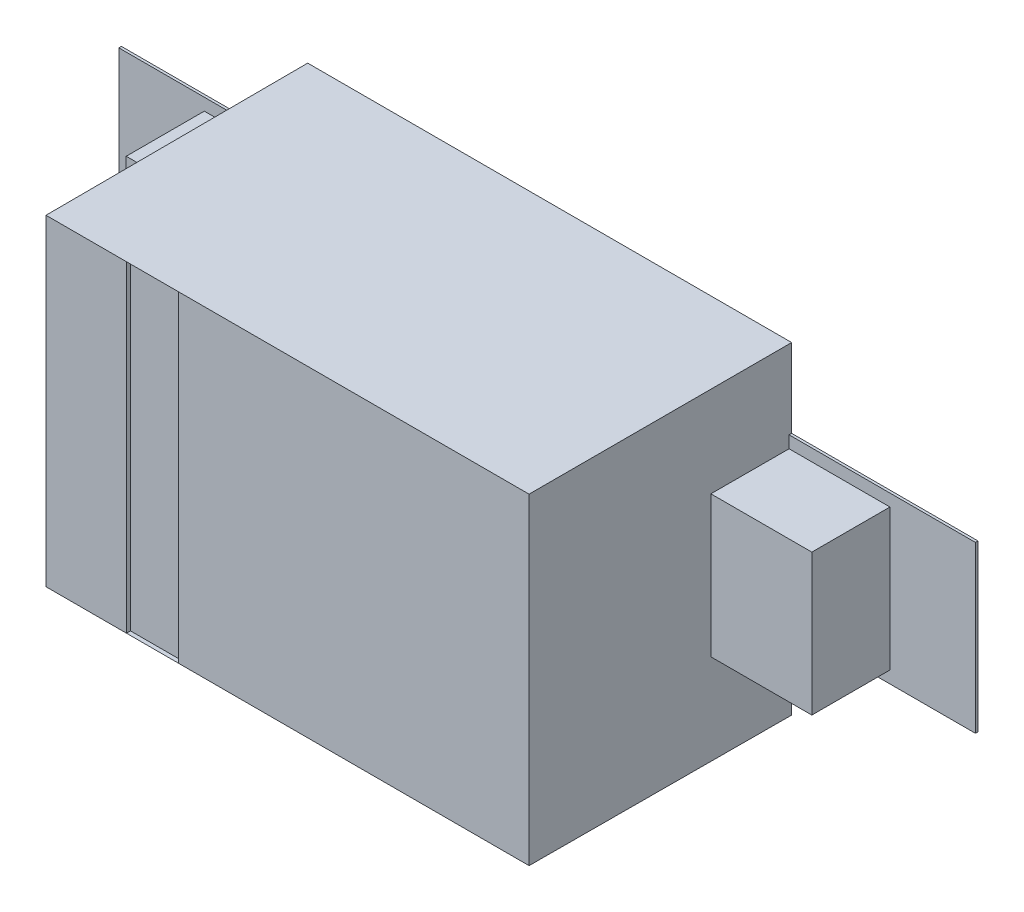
ISO-10303-21;
HEADER;
FILE_DESCRIPTION(('STEP AP214'),'2;1');
FILE_NAME('part.step','',(''),(''),'','','');
FILE_SCHEMA(('AUTOMOTIVE_DESIGN { 1 0 10303 214 1 1 1 1 }'));
ENDSEC;
DATA;
#1=APPLICATION_CONTEXT('core data for automotive mechanical design processes');
#2=APPLICATION_PROTOCOL_DEFINITION('international standard','automotive_design',2000,#1);
#3=PRODUCT_CONTEXT('',#1,'mechanical');
#4=PRODUCT('Part','Part','',(#3));
#5=PRODUCT_RELATED_PRODUCT_CATEGORY('part','',(#4));
#6=PRODUCT_DEFINITION_FORMATION('','',#4);
#7=PRODUCT_DEFINITION_CONTEXT('part definition',#1,'design');
#8=PRODUCT_DEFINITION('design','',#6,#7);
#9=PRODUCT_DEFINITION_SHAPE('','',#8);
#10=(LENGTH_UNIT() NAMED_UNIT(*) SI_UNIT(.MILLI.,.METRE.));
#11=(NAMED_UNIT(*) PLANE_ANGLE_UNIT() SI_UNIT($,.RADIAN.));
#12=(NAMED_UNIT(*) SI_UNIT($,.STERADIAN.) SOLID_ANGLE_UNIT());
#13=UNCERTAINTY_MEASURE_WITH_UNIT(LENGTH_MEASURE(1.E-05),#10,'distance_accuracy_value','');
#14=(GEOMETRIC_REPRESENTATION_CONTEXT(3) GLOBAL_UNCERTAINTY_ASSIGNED_CONTEXT((#13)) GLOBAL_UNIT_ASSIGNED_CONTEXT((#10,
#11,#12)) REPRESENTATION_CONTEXT('',''));
#15=CARTESIAN_POINT('',(0.,0.,0.));
#16=DIRECTION('',(0.,0.,1.));
#17=DIRECTION('',(1.,0.,0.));
#18=AXIS2_PLACEMENT_3D('',#15,#16,#17);
#19=CARTESIAN_POINT('',(0.849999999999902,0.175000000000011,0.0030000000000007));
#20=DIRECTION('',(1.,0.,0.));
#21=DIRECTION('',(0.,0.,-1.));
#22=AXIS2_PLACEMENT_3D('',#19,#20,#21);
#23=PLANE('',#22);
#24=DIRECTION('',(0.,0.,-1.));
#25=VECTOR('',#24,1.);
#26=CARTESIAN_POINT('',(0.849999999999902,-0.175000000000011,0.0030000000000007));
#27=LINE('',#26,#25);
#28=CARTESIAN_POINT('',(0.849999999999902,-0.175000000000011,0.0093500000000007));
#29=VERTEX_POINT('',#28);
#30=CARTESIAN_POINT('',(0.849999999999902,-0.175000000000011,0.203000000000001));
#31=VERTEX_POINT('',#30);
#32=EDGE_CURVE('E180',#29,#31,#27,.F.);
#33=ORIENTED_EDGE('',*,*,#32,.F.);
#34=DIRECTION('',(0.,1.,0.));
#35=VECTOR('',#34,1.);
#36=CARTESIAN_POINT('',(0.849999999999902,0.,0.0093500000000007));
#37=LINE('',#36,#35);
#38=CARTESIAN_POINT('',(0.849999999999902,0.175000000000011,0.0093500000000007));
#39=VERTEX_POINT('',#38);
#40=EDGE_CURVE('E260',#29,#39,#37,.T.);
#41=ORIENTED_EDGE('',*,*,#40,.T.);
#42=DIRECTION('',(0.,0.,1.));
#43=VECTOR('',#42,1.);
#44=CARTESIAN_POINT('',(0.849999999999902,0.175000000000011,0.0030000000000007));
#45=LINE('',#44,#43);
#46=CARTESIAN_POINT('',(0.849999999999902,0.175000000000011,0.203000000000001));
#47=VERTEX_POINT('',#46);
#48=EDGE_CURVE('E196',#47,#39,#45,.F.);
#49=ORIENTED_EDGE('',*,*,#48,.F.);
#50=DIRECTION('',(0.,1.,0.));
#51=VECTOR('',#50,1.);
#52=CARTESIAN_POINT('',(0.849999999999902,0.,0.203000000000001));
#53=LINE('',#52,#51);
#54=EDGE_CURVE('E174',#47,#31,#53,.F.);
#55=ORIENTED_EDGE('',*,*,#54,.T.);
#56=EDGE_LOOP('',(#33,#41,#49,#55));
#57=FACE_BOUND('',#56,.T.);
#58=ADVANCED_FACE('F16',(#57),#23,.T.);
#59=CARTESIAN_POINT('',(-0.849999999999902,-0.175000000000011,0.0030000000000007));
#60=DIRECTION('',(-1.,0.,0.));
#61=DIRECTION('',(0.,0.,1.));
#62=AXIS2_PLACEMENT_3D('',#59,#60,#61);
#63=PLANE('',#62);
#64=DIRECTION('',(0.,0.,1.));
#65=VECTOR('',#64,1.);
#66=CARTESIAN_POINT('',(-0.849999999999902,0.175000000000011,0.0030000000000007));
#67=LINE('',#66,#65);
#68=CARTESIAN_POINT('',(-0.849999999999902,0.175000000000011,0.0093500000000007));
#69=VERTEX_POINT('',#68);
#70=CARTESIAN_POINT('',(-0.849999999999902,0.175000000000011,0.203000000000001));
#71=VERTEX_POINT('',#70);
#72=EDGE_CURVE('E249',#69,#71,#67,.T.);
#73=ORIENTED_EDGE('',*,*,#72,.F.);
#74=DIRECTION('',(0.,1.,0.));
#75=VECTOR('',#74,1.);
#76=CARTESIAN_POINT('',(-0.849999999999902,0.,0.0093500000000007));
#77=LINE('',#76,#75);
#78=CARTESIAN_POINT('',(-0.849999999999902,-0.175000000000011,0.0093500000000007));
#79=VERTEX_POINT('',#78);
#80=EDGE_CURVE('E232',#69,#79,#77,.F.);
#81=ORIENTED_EDGE('',*,*,#80,.T.);
#82=DIRECTION('',(0.,0.,-1.));
#83=VECTOR('',#82,1.);
#84=CARTESIAN_POINT('',(-0.849999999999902,-0.175000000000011,0.0030000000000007));
#85=LINE('',#84,#83);
#86=CARTESIAN_POINT('',(-0.849999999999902,-0.175000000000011,0.203000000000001));
#87=VERTEX_POINT('',#86);
#88=EDGE_CURVE('E238',#87,#79,#85,.T.);
#89=ORIENTED_EDGE('',*,*,#88,.F.);
#90=DIRECTION('',(0.,1.,0.));
#91=VECTOR('',#90,1.);
#92=CARTESIAN_POINT('',(-0.849999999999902,0.,0.203000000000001));
#93=LINE('',#92,#91);
#94=EDGE_CURVE('E246',#87,#71,#93,.T.);
#95=ORIENTED_EDGE('',*,*,#94,.T.);
#96=EDGE_LOOP('',(#73,#81,#89,#95));
#97=FACE_BOUND('',#96,.T.);
#98=ADVANCED_FACE('F498',(#97),#63,.T.);
#99=CARTESIAN_POINT('',(-0.399389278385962,0.39886555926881,0.652985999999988));
#100=DIRECTION('',(-1.,0.,0.));
#101=DIRECTION('',(0.,0.,1.));
#102=AXIS2_PLACEMENT_3D('',#99,#100,#101);
#103=PLANE('',#102);
#104=DIRECTION('',(0.,1.,0.));
#105=VECTOR('',#104,1.);
#106=CARTESIAN_POINT('',(-0.399389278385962,0.,0.642986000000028));
#107=LINE('',#106,#105);
#108=CARTESIAN_POINT('',(-0.399389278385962,0.39886555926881,0.642986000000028));
#109=VERTEX_POINT('',#108);
#110=CARTESIAN_POINT('',(-0.399389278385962,-0.39886555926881,0.642986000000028));
#111=VERTEX_POINT('',#110);
#112=EDGE_CURVE('E19',#109,#111,#107,.F.);
#113=ORIENTED_EDGE('',*,*,#112,.F.);
#114=DIRECTION('',(0.,0.,1.));
#115=VECTOR('',#114,1.);
#116=CARTESIAN_POINT('',(-0.399389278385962,0.39886555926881,0.652985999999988));
#117=LINE('',#116,#115);
#118=CARTESIAN_POINT('',(-0.399389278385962,0.398865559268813,0.652985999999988));
#119=VERTEX_POINT('',#118);
#120=EDGE_CURVE('E251',#109,#119,#117,.T.);
#121=ORIENTED_EDGE('',*,*,#120,.T.);
#122=DIRECTION('',(0.,1.,0.));
#123=VECTOR('',#122,1.);
#124=CARTESIAN_POINT('',(-0.399389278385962,0.,0.652985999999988));
#125=LINE('',#124,#123);
#126=CARTESIAN_POINT('',(-0.399389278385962,-0.398865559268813,0.652985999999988));
#127=VERTEX_POINT('',#126);
#128=EDGE_CURVE('E221',#127,#119,#125,.T.);
#129=ORIENTED_EDGE('',*,*,#128,.F.);
#130=DIRECTION('',(0.,0.,-1.));
#131=VECTOR('',#130,1.);
#132=CARTESIAN_POINT('',(-0.399389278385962,-0.39886555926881,0.652985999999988));
#133=LINE('',#132,#131);
#134=EDGE_CURVE('E215',#127,#111,#133,.T.);
#135=ORIENTED_EDGE('',*,*,#134,.T.);
#136=EDGE_LOOP('',(#113,#121,#129,#135));
#137=FACE_BOUND('',#136,.T.);
#138=ADVANCED_FACE('F220',(#137),#103,.F.);
#139=CARTESIAN_POINT('',(0.,0.,0.642986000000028));
#140=DIRECTION('',(0.,0.,1.));
#141=DIRECTION('',(1.,0.,0.));
#142=AXIS2_PLACEMENT_3D('',#139,#140,#141);
#143=PLANE('',#142);
#144=DIRECTION('',(1.,0.,0.));
#145=VECTOR('',#144,1.);
#146=CARTESIAN_POINT('',(-0.270648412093,0.39886555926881,0.642986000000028));
#147=LINE('',#146,#145);
#148=CARTESIAN_POINT('',(-0.270648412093,0.39886555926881,0.642986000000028));
#149=VERTEX_POINT('',#148);
#150=EDGE_CURVE('E206',#149,#109,#147,.F.);
#151=ORIENTED_EDGE('',*,*,#150,.T.);
#152=ORIENTED_EDGE('',*,*,#112,.T.);
#153=DIRECTION('',(1.,0.,0.));
#154=VECTOR('',#153,1.);
#155=CARTESIAN_POINT('',(-0.399389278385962,-0.39886555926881,0.642986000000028));
#156=LINE('',#155,#154);
#157=CARTESIAN_POINT('',(-0.270648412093,-0.39886555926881,0.642986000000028));
#158=VERTEX_POINT('',#157);
#159=EDGE_CURVE('E205',#111,#158,#156,.T.);
#160=ORIENTED_EDGE('',*,*,#159,.T.);
#161=DIRECTION('',(0.,1.,0.));
#162=VECTOR('',#161,1.);
#163=CARTESIAN_POINT('',(-0.270648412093,-0.39886555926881,0.642986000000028));
#164=LINE('',#163,#162);
#165=EDGE_CURVE('E189',#158,#149,#164,.T.);
#166=ORIENTED_EDGE('',*,*,#165,.T.);
#167=EDGE_LOOP('',(#151,#152,#160,#166));
#168=FACE_BOUND('',#167,.T.);
#169=ADVANCED_FACE('F204',(#168),#143,.T.);
#170=CARTESIAN_POINT('',(-0.270648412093,-0.39886555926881,0.652985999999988));
#171=DIRECTION('',(1.,0.,0.));
#172=DIRECTION('',(0.,0.,-1.));
#173=AXIS2_PLACEMENT_3D('',#170,#171,#172);
#174=PLANE('',#173);
#175=ORIENTED_EDGE('',*,*,#165,.F.);
#176=DIRECTION('',(0.,0.,-1.));
#177=VECTOR('',#176,1.);
#178=CARTESIAN_POINT('',(-0.270648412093,-0.39886555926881,0.652985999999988));
#179=LINE('',#178,#177);
#180=CARTESIAN_POINT('',(-0.270648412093,-0.398865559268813,0.652985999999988));
#181=VERTEX_POINT('',#180);
#182=EDGE_CURVE('E218',#158,#181,#179,.F.);
#183=ORIENTED_EDGE('',*,*,#182,.T.);
#184=DIRECTION('',(0.,1.,0.));
#185=VECTOR('',#184,1.);
#186=CARTESIAN_POINT('',(-0.270648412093,0.,0.652985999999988));
#187=LINE('',#186,#185);
#188=CARTESIAN_POINT('',(-0.270648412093,0.398865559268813,0.652985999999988));
#189=VERTEX_POINT('',#188);
#190=EDGE_CURVE('E223',#189,#181,#187,.F.);
#191=ORIENTED_EDGE('',*,*,#190,.F.);
#192=DIRECTION('',(0.,0.,1.));
#193=VECTOR('',#192,1.);
#194=CARTESIAN_POINT('',(-0.270648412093,0.39886555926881,0.652985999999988));
#195=LINE('',#194,#193);
#196=EDGE_CURVE('E254',#189,#149,#195,.F.);
#197=ORIENTED_EDGE('',*,*,#196,.T.);
#198=EDGE_LOOP('',(#175,#183,#191,#197));
#199=FACE_BOUND('',#198,.T.);
#200=ADVANCED_FACE('F301',(#199),#174,.F.);
#201=CARTESIAN_POINT('',(0.849999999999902,-0.175000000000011,0.0030000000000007));
#202=DIRECTION('',(0.,-1.,0.));
#203=DIRECTION('',(0.,0.,-1.));
#204=AXIS2_PLACEMENT_3D('',#201,#202,#203);
#205=PLANE('',#204);
#206=DIRECTION('',(0.00174532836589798,0.,-0.999998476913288));
#207=VECTOR('',#206,1.);
#208=CARTESIAN_POINT('',(0.599999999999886,-0.175000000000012,0.0030000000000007));
#209=LINE('',#208,#207);
#210=CARTESIAN_POINT('',(0.599988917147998,-0.175000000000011,0.00935000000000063));
#211=VERTEX_POINT('',#210);
#212=CARTESIAN_POINT('',(0.599650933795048,-0.175000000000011,0.203000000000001));
#213=VERTEX_POINT('',#212);
#214=EDGE_CURVE('E275',#211,#213,#209,.F.);
#215=ORIENTED_EDGE('',*,*,#214,.F.);
#216=DIRECTION('',(-1.,0.,0.));
#217=VECTOR('',#216,1.);
#218=CARTESIAN_POINT('',(0.,-0.175000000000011,0.0093500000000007));
#219=LINE('',#218,#217);
#220=EDGE_CURVE('E185',#211,#29,#219,.F.);
#221=ORIENTED_EDGE('',*,*,#220,.T.);
#222=ORIENTED_EDGE('',*,*,#32,.T.);
#223=DIRECTION('',(-1.,0.,0.));
#224=VECTOR('',#223,1.);
#225=CARTESIAN_POINT('',(0.,-0.175000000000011,0.203000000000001));
#226=LINE('',#225,#224);
#227=EDGE_CURVE('E183',#31,#213,#226,.T.);
#228=ORIENTED_EDGE('',*,*,#227,.T.);
#229=EDGE_LOOP('',(#215,#221,#222,#228));
#230=FACE_BOUND('',#229,.T.);
#231=ADVANCED_FACE('F182',(#230),#205,.T.);
#232=CARTESIAN_POINT('',(0.,0.,0.203000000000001));
#233=DIRECTION('',(0.,0.,-1.));
#234=DIRECTION('',(-1.,0.,0.));
#235=AXIS2_PLACEMENT_3D('',#232,#233,#234);
#236=PLANE('',#235);
#237=ORIENTED_EDGE('',*,*,#54,.F.);
#238=DIRECTION('',(1.,0.,0.));
#239=VECTOR('',#238,1.);
#240=CARTESIAN_POINT('',(0.538999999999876,0.175000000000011,0.203000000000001));
#241=LINE('',#240,#239);
#242=CARTESIAN_POINT('',(0.599650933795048,0.175000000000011,0.203000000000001));
#243=VERTEX_POINT('',#242);
#244=EDGE_CURVE('E193',#243,#47,#241,.T.);
#245=ORIENTED_EDGE('',*,*,#244,.F.);
#246=DIRECTION('',(0.,1.,0.));
#247=VECTOR('',#246,1.);
#248=CARTESIAN_POINT('',(0.599650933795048,-25.8310794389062,0.203000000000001));
#249=LINE('',#248,#247);
#250=EDGE_CURVE('E192',#213,#243,#249,.T.);
#251=ORIENTED_EDGE('',*,*,#250,.F.);
#252=ORIENTED_EDGE('',*,*,#227,.F.);
#253=EDGE_LOOP('',(#237,#245,#251,#252));
#254=FACE_BOUND('',#253,.T.);
#255=ADVANCED_FACE('F191',(#254),#236,.F.);
#256=CARTESIAN_POINT('',(0.538999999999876,0.175000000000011,0.0030000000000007));
#257=DIRECTION('',(0.,1.,0.));
#258=DIRECTION('',(0.,0.,1.));
#259=AXIS2_PLACEMENT_3D('',#256,#257,#258);
#260=PLANE('',#259);
#261=ORIENTED_EDGE('',*,*,#48,.T.);
#262=DIRECTION('',(-1.,0.,0.));
#263=VECTOR('',#262,1.);
#264=CARTESIAN_POINT('',(0.,0.175000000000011,0.0093500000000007));
#265=LINE('',#264,#263);
#266=CARTESIAN_POINT('',(0.599988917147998,0.175000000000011,0.00935000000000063));
#267=VERTEX_POINT('',#266);
#268=EDGE_CURVE('E257',#39,#267,#265,.T.);
#269=ORIENTED_EDGE('',*,*,#268,.T.);
#270=DIRECTION('',(0.00174532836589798,0.,-0.999998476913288));
#271=VECTOR('',#270,1.);
#272=CARTESIAN_POINT('',(0.599999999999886,0.175000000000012,0.0030000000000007));
#273=LINE('',#272,#271);
#274=EDGE_CURVE('E267',#243,#267,#273,.T.);
#275=ORIENTED_EDGE('',*,*,#274,.F.);
#276=ORIENTED_EDGE('',*,*,#244,.T.);
#277=EDGE_LOOP('',(#261,#269,#275,#276));
#278=FACE_BOUND('',#277,.T.);
#279=ADVANCED_FACE('F265',(#278),#260,.T.);
#280=CARTESIAN_POINT('',(0.,0.,0.0093500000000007));
#281=DIRECTION('',(0.,0.,-1.));
#282=DIRECTION('',(-1.,0.,0.));
#283=AXIS2_PLACEMENT_3D('',#280,#281,#282);
#284=PLANE('',#283);
#285=ORIENTED_EDGE('',*,*,#40,.F.);
#286=ORIENTED_EDGE('',*,*,#220,.F.);
#287=DIRECTION('',(0.,1.,0.));
#288=VECTOR('',#287,1.);
#289=CARTESIAN_POINT('',(0.599988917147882,-25.8310794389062,0.00935000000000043));
#290=LINE('',#289,#288);
#291=CARTESIAN_POINT('',(0.599988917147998,-0.204999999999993,0.00935000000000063));
#292=VERTEX_POINT('',#291);
#293=EDGE_CURVE('E280',#292,#211,#290,.T.);
#294=ORIENTED_EDGE('',*,*,#293,.F.);
#295=DIRECTION('',(1.,0.,0.));
#296=VECTOR('',#295,1.);
#297=CARTESIAN_POINT('',(1.06200000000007,-0.204999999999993,0.0093500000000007));
#298=LINE('',#297,#296);
#299=CARTESIAN_POINT('',(1.06200000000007,-0.204999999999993,0.0093500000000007));
#300=VERTEX_POINT('',#299);
#301=EDGE_CURVE('E298',#300,#292,#298,.F.);
#302=ORIENTED_EDGE('',*,*,#301,.F.);
#303=DIRECTION('',(0.,1.,0.));
#304=VECTOR('',#303,1.);
#305=CARTESIAN_POINT('',(1.06200000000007,0.204999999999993,0.0093500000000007));
#306=LINE('',#305,#304);
#307=CARTESIAN_POINT('',(1.06200000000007,0.204999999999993,0.0093500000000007));
#308=VERTEX_POINT('',#307);
#309=EDGE_CURVE('E296',#308,#300,#306,.F.);
#310=ORIENTED_EDGE('',*,*,#309,.F.);
#311=DIRECTION('',(1.,0.,0.));
#312=VECTOR('',#311,1.);
#313=CARTESIAN_POINT('',(0.372000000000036,0.204999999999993,0.0093500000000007));
#314=LINE('',#313,#312);
#315=CARTESIAN_POINT('',(0.599988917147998,0.204999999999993,0.00935000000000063));
#316=VERTEX_POINT('',#315);
#317=EDGE_CURVE('E292',#316,#308,#314,.T.);
#318=ORIENTED_EDGE('',*,*,#317,.F.);
#319=DIRECTION('',(0.,1.,0.));
#320=VECTOR('',#319,1.);
#321=CARTESIAN_POINT('',(0.599988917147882,-25.8310794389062,0.00935000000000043));
#322=LINE('',#321,#320);
#323=EDGE_CURVE('E271',#267,#316,#322,.T.);
#324=ORIENTED_EDGE('',*,*,#323,.F.);
#325=ORIENTED_EDGE('',*,*,#268,.F.);
#326=EDGE_LOOP('',(#285,#286,#294,#302,#310,#318,#324,#325));
#327=FACE_BOUND('',#326,.T.);
#328=ADVANCED_FACE('F425',(#327),#284,.F.);
#329=CARTESIAN_POINT('',(-0.270648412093,0.39886555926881,0.652985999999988));
#330=DIRECTION('',(0.,1.,0.));
#331=DIRECTION('',(0.,0.,1.));
#332=AXIS2_PLACEMENT_3D('',#329,#330,#331);
#333=PLANE('',#332);
#334=ORIENTED_EDGE('',*,*,#150,.F.);
#335=ORIENTED_EDGE('',*,*,#196,.F.);
#336=DIRECTION('',(1.,0.,0.));
#337=VECTOR('',#336,1.);
#338=CARTESIAN_POINT('',(26.0310794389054,0.398865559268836,0.652985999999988));
#339=LINE('',#338,#337);
#340=EDGE_CURVE('E351',#119,#189,#339,.T.);
#341=ORIENTED_EDGE('',*,*,#340,.F.);
#342=ORIENTED_EDGE('',*,*,#120,.F.);
#343=EDGE_LOOP('',(#334,#335,#341,#342));
#344=FACE_BOUND('',#343,.T.);
#345=ADVANCED_FACE('F422',(#344),#333,.F.);
#346=CARTESIAN_POINT('',(-0.849999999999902,0.175000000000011,0.0030000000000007));
#347=DIRECTION('',(0.,1.,0.));
#348=DIRECTION('',(0.,0.,1.));
#349=AXIS2_PLACEMENT_3D('',#346,#347,#348);
#350=PLANE('',#349);
#351=DIRECTION('',(-1.,0.,0.));
#352=VECTOR('',#351,1.);
#353=CARTESIAN_POINT('',(0.,0.175000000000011,0.203000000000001));
#354=LINE('',#353,#352);
#355=CARTESIAN_POINT('',(-0.599650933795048,0.175000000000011,0.203000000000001));
#356=VERTEX_POINT('',#355);
#357=EDGE_CURVE('E243',#71,#356,#354,.F.);
#358=ORIENTED_EDGE('',*,*,#357,.T.);
#359=DIRECTION('',(0.00174532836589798,0.,0.999998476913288));
#360=VECTOR('',#359,1.);
#361=CARTESIAN_POINT('',(-0.599999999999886,0.175000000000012,0.0030000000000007));
#362=LINE('',#361,#360);
#363=CARTESIAN_POINT('',(-0.599988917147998,0.175000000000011,0.00935000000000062));
#364=VERTEX_POINT('',#363);
#365=EDGE_CURVE('E339',#364,#356,#362,.T.);
#366=ORIENTED_EDGE('',*,*,#365,.F.);
#367=DIRECTION('',(-1.,0.,0.));
#368=VECTOR('',#367,1.);
#369=CARTESIAN_POINT('',(0.,0.175000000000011,0.0093500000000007));
#370=LINE('',#369,#368);
#371=EDGE_CURVE('E235',#364,#69,#370,.T.);
#372=ORIENTED_EDGE('',*,*,#371,.T.);
#373=ORIENTED_EDGE('',*,*,#72,.T.);
#374=EDGE_LOOP('',(#358,#366,#372,#373));
#375=FACE_BOUND('',#374,.T.);
#376=ADVANCED_FACE('F424',(#375),#350,.T.);
#377=CARTESIAN_POINT('',(0.,0.,0.203000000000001));
#378=DIRECTION('',(0.,0.,-1.));
#379=DIRECTION('',(-1.,0.,0.));
#380=AXIS2_PLACEMENT_3D('',#377,#378,#379);
#381=PLANE('',#380);
#382=ORIENTED_EDGE('',*,*,#94,.F.);
#383=DIRECTION('',(1.,0.,0.));
#384=VECTOR('',#383,1.);
#385=CARTESIAN_POINT('',(-0.538999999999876,-0.175000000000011,0.203000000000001));
#386=LINE('',#385,#384);
#387=CARTESIAN_POINT('',(-0.599650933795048,-0.175000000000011,0.203000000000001));
#388=VERTEX_POINT('',#387);
#389=EDGE_CURVE('E240',#388,#87,#386,.F.);
#390=ORIENTED_EDGE('',*,*,#389,.F.);
#391=DIRECTION('',(0.,1.,0.));
#392=VECTOR('',#391,1.);
#393=CARTESIAN_POINT('',(-0.599650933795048,25.8310794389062,0.203000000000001));
#394=LINE('',#393,#392);
#395=EDGE_CURVE('E337',#356,#388,#394,.F.);
#396=ORIENTED_EDGE('',*,*,#395,.F.);
#397=ORIENTED_EDGE('',*,*,#357,.F.);
#398=EDGE_LOOP('',(#382,#390,#396,#397));
#399=FACE_BOUND('',#398,.T.);
#400=ADVANCED_FACE('F432',(#399),#381,.F.);
#401=CARTESIAN_POINT('',(-0.538999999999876,-0.175000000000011,0.0030000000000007));
#402=DIRECTION('',(0.,-1.,0.));
#403=DIRECTION('',(0.,0.,-1.));
#404=AXIS2_PLACEMENT_3D('',#401,#402,#403);
#405=PLANE('',#404);
#406=DIRECTION('',(-1.,0.,0.));
#407=VECTOR('',#406,1.);
#408=CARTESIAN_POINT('',(0.,-0.175000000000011,0.0093500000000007));
#409=LINE('',#408,#407);
#410=CARTESIAN_POINT('',(-0.599988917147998,-0.175000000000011,0.00935000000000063));
#411=VERTEX_POINT('',#410);
#412=EDGE_CURVE('E229',#79,#411,#409,.F.);
#413=ORIENTED_EDGE('',*,*,#412,.T.);
#414=DIRECTION('',(0.00174532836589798,0.,0.999998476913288));
#415=VECTOR('',#414,1.);
#416=CARTESIAN_POINT('',(-0.599999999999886,-0.175000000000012,0.0030000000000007));
#417=LINE('',#416,#415);
#418=EDGE_CURVE('E335',#388,#411,#417,.F.);
#419=ORIENTED_EDGE('',*,*,#418,.F.);
#420=ORIENTED_EDGE('',*,*,#389,.T.);
#421=ORIENTED_EDGE('',*,*,#88,.T.);
#422=EDGE_LOOP('',(#413,#419,#420,#421));
#423=FACE_BOUND('',#422,.T.);
#424=ADVANCED_FACE('F482',(#423),#405,.T.);
#425=CARTESIAN_POINT('',(0.,0.,0.0093500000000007));
#426=DIRECTION('',(0.,0.,-1.));
#427=DIRECTION('',(-1.,0.,0.));
#428=AXIS2_PLACEMENT_3D('',#425,#426,#427);
#429=PLANE('',#428);
#430=DIRECTION('',(0.,1.,0.));
#431=VECTOR('',#430,1.);
#432=CARTESIAN_POINT('',(-1.06200000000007,-0.204999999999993,0.0093500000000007));
#433=LINE('',#432,#431);
#434=CARTESIAN_POINT('',(-1.06200000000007,-0.204999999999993,0.0093500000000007));
#435=VERTEX_POINT('',#434);
#436=CARTESIAN_POINT('',(-1.06200000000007,0.204999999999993,0.0093500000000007));
#437=VERTEX_POINT('',#436);
#438=EDGE_CURVE('E347',#435,#437,#433,.T.);
#439=ORIENTED_EDGE('',*,*,#438,.F.);
#440=DIRECTION('',(1.,0.,0.));
#441=VECTOR('',#440,1.);
#442=CARTESIAN_POINT('',(-0.372000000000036,-0.204999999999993,0.0093500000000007));
#443=LINE('',#442,#441);
#444=CARTESIAN_POINT('',(-0.599988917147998,-0.204999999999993,0.00935000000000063));
#445=VERTEX_POINT('',#444);
#446=EDGE_CURVE('E343',#445,#435,#443,.F.);
#447=ORIENTED_EDGE('',*,*,#446,.F.);
#448=DIRECTION('',(0.,1.,0.));
#449=VECTOR('',#448,1.);
#450=CARTESIAN_POINT('',(-0.599988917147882,25.8310794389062,0.00935000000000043));
#451=LINE('',#450,#449);
#452=EDGE_CURVE('E333',#411,#445,#451,.F.);
#453=ORIENTED_EDGE('',*,*,#452,.F.);
#454=ORIENTED_EDGE('',*,*,#412,.F.);
#455=ORIENTED_EDGE('',*,*,#80,.F.);
#456=ORIENTED_EDGE('',*,*,#371,.F.);
#457=DIRECTION('',(0.,1.,0.));
#458=VECTOR('',#457,1.);
#459=CARTESIAN_POINT('',(-0.599988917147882,25.8310794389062,0.00935000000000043));
#460=LINE('',#459,#458);
#461=CARTESIAN_POINT('',(-0.599988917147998,0.204999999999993,0.00935000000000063));
#462=VERTEX_POINT('',#461);
#463=EDGE_CURVE('E321',#462,#364,#460,.F.);
#464=ORIENTED_EDGE('',*,*,#463,.F.);
#465=DIRECTION('',(1.,0.,0.));
#466=VECTOR('',#465,1.);
#467=CARTESIAN_POINT('',(-1.06200000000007,0.204999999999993,0.0093500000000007));
#468=LINE('',#467,#466);
#469=EDGE_CURVE('E349',#437,#462,#468,.T.);
#470=ORIENTED_EDGE('',*,*,#469,.F.);
#471=EDGE_LOOP('',(#439,#447,#453,#454,#455,#456,#464,#470));
#472=FACE_BOUND('',#471,.T.);
#473=ADVANCED_FACE('F479',(#472),#429,.F.);
#474=CARTESIAN_POINT('',(0.,0.,0.652985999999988));
#475=DIRECTION('',(0.,0.,1.));
#476=DIRECTION('',(1.,0.,0.));
#477=AXIS2_PLACEMENT_3D('',#474,#475,#476);
#478=PLANE('',#477);
#479=DIRECTION('',(1.,0.,0.));
#480=VECTOR('',#479,1.);
#481=CARTESIAN_POINT('',(-26.0310794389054,-0.398865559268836,0.652985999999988));
#482=LINE('',#481,#480);
#483=CARTESIAN_POINT('',(-0.598865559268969,-0.398865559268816,0.652985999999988));
#484=VERTEX_POINT('',#483);
#485=EDGE_CURVE('E319',#127,#484,#482,.F.);
#486=ORIENTED_EDGE('',*,*,#485,.F.);
#487=ORIENTED_EDGE('',*,*,#128,.T.);
#488=DIRECTION('',(1.,0.,0.));
#489=VECTOR('',#488,1.);
#490=CARTESIAN_POINT('',(26.0310794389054,0.398865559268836,0.652985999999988));
#491=LINE('',#490,#489);
#492=CARTESIAN_POINT('',(-0.598865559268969,0.398865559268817,0.652985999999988));
#493=VERTEX_POINT('',#492);
#494=EDGE_CURVE('E353',#493,#119,#491,.T.);
#495=ORIENTED_EDGE('',*,*,#494,.F.);
#496=DIRECTION('',(0.,1.,0.));
#497=VECTOR('',#496,1.);
#498=CARTESIAN_POINT('',(-0.598865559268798,25.8310794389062,0.652985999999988));
#499=LINE('',#498,#497);
#500=EDGE_CURVE('E329',#484,#493,#499,.T.);
#501=ORIENTED_EDGE('',*,*,#500,.F.);
#502=EDGE_LOOP('',(#486,#487,#495,#501));
#503=FACE_BOUND('',#502,.T.);
#504=ADVANCED_FACE('F476',(#503),#478,.T.);
#505=CARTESIAN_POINT('',(0.,0.,0.652985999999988));
#506=DIRECTION('',(0.,0.,1.));
#507=DIRECTION('',(1.,0.,0.));
#508=AXIS2_PLACEMENT_3D('',#505,#506,#507);
#509=PLANE('',#508);
#510=DIRECTION('',(1.,0.,0.));
#511=VECTOR('',#510,1.);
#512=CARTESIAN_POINT('',(26.0310794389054,0.398865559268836,0.652985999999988));
#513=LINE('',#512,#511);
#514=CARTESIAN_POINT('',(0.598865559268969,0.398865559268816,0.652985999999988));
#515=VERTEX_POINT('',#514);
#516=EDGE_CURVE('E273',#189,#515,#513,.T.);
#517=ORIENTED_EDGE('',*,*,#516,.F.);
#518=ORIENTED_EDGE('',*,*,#190,.T.);
#519=DIRECTION('',(1.,0.,0.));
#520=VECTOR('',#519,1.);
#521=CARTESIAN_POINT('',(-26.0310794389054,-0.398865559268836,0.652985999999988));
#522=LINE('',#521,#520);
#523=CARTESIAN_POINT('',(0.598865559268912,-0.398865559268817,0.652985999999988));
#524=VERTEX_POINT('',#523);
#525=EDGE_CURVE('E307',#524,#181,#522,.F.);
#526=ORIENTED_EDGE('',*,*,#525,.F.);
#527=DIRECTION('',(0.,1.,0.));
#528=VECTOR('',#527,1.);
#529=CARTESIAN_POINT('',(0.598865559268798,-25.8310794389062,0.652985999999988));
#530=LINE('',#529,#528);
#531=EDGE_CURVE('E286',#515,#524,#530,.F.);
#532=ORIENTED_EDGE('',*,*,#531,.F.);
#533=EDGE_LOOP('',(#517,#518,#526,#532));
#534=FACE_BOUND('',#533,.T.);
#535=ADVANCED_FACE('F367',(#534),#509,.T.);
#536=CARTESIAN_POINT('',(-0.399389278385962,-0.39886555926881,0.652985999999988));
#537=DIRECTION('',(0.,-1.,0.));
#538=DIRECTION('',(0.,0.,-1.));
#539=AXIS2_PLACEMENT_3D('',#536,#537,#538);
#540=PLANE('',#539);
#541=ORIENTED_EDGE('',*,*,#159,.F.);
#542=ORIENTED_EDGE('',*,*,#134,.F.);
#543=DIRECTION('',(1.,0.,0.));
#544=VECTOR('',#543,1.);
#545=CARTESIAN_POINT('',(-26.0310794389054,-0.398865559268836,0.652985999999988));
#546=LINE('',#545,#544);
#547=EDGE_CURVE('E303',#181,#127,#546,.F.);
#548=ORIENTED_EDGE('',*,*,#547,.F.);
#549=ORIENTED_EDGE('',*,*,#182,.F.);
#550=EDGE_LOOP('',(#541,#542,#548,#549));
#551=FACE_BOUND('',#550,.T.);
#552=ADVANCED_FACE('F213',(#551),#540,.F.);
#553=CARTESIAN_POINT('',(1.06200000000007,-0.204999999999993,0.0030000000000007));
#554=DIRECTION('',(0.,-1.,0.));
#555=DIRECTION('',(0.,0.,-1.));
#556=AXIS2_PLACEMENT_3D('',#553,#554,#555);
#557=PLANE('',#556);
#558=ORIENTED_EDGE('',*,*,#301,.T.);
#559=DIRECTION('',(0.00174532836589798,0.,-0.999998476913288));
#560=VECTOR('',#559,1.);
#561=CARTESIAN_POINT('',(0.599999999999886,-0.204999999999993,0.0030000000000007));
#562=LINE('',#561,#560);
#563=CARTESIAN_POINT('',(0.599999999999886,-0.204999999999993,0.0030000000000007));
#564=VERTEX_POINT('',#563);
#565=EDGE_CURVE('E283',#564,#292,#562,.F.);
#566=ORIENTED_EDGE('',*,*,#565,.F.);
#567=DIRECTION('',(1.,0.,0.));
#568=VECTOR('',#567,1.);
#569=CARTESIAN_POINT('',(0.,-0.204999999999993,0.0030000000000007));
#570=LINE('',#569,#568);
#571=CARTESIAN_POINT('',(1.06200000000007,-0.204999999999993,0.0030000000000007));
#572=VERTEX_POINT('',#571);
#573=EDGE_CURVE('E310',#564,#572,#570,.T.);
#574=ORIENTED_EDGE('',*,*,#573,.T.);
#575=DIRECTION('',(0.,0.,-1.));
#576=VECTOR('',#575,1.);
#577=CARTESIAN_POINT('',(1.06200000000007,-0.204999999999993,0.0030000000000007));
#578=LINE('',#577,#576);
#579=EDGE_CURVE('E294',#300,#572,#578,.T.);
#580=ORIENTED_EDGE('',*,*,#579,.F.);
#581=EDGE_LOOP('',(#558,#566,#574,#580));
#582=FACE_BOUND('',#581,.T.);
#583=ADVANCED_FACE('F391',(#582),#557,.T.);
#584=CARTESIAN_POINT('',(1.06200000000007,0.204999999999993,0.0030000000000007));
#585=DIRECTION('',(1.,0.,0.));
#586=DIRECTION('',(0.,0.,-1.));
#587=AXIS2_PLACEMENT_3D('',#584,#585,#586);
#588=PLANE('',#587);
#589=ORIENTED_EDGE('',*,*,#579,.T.);
#590=DIRECTION('',(0.,1.,0.));
#591=VECTOR('',#590,1.);
#592=CARTESIAN_POINT('',(1.06200000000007,0.,0.0030000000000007));
#593=LINE('',#592,#591);
#594=CARTESIAN_POINT('',(1.06200000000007,0.204999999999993,0.0030000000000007));
#595=VERTEX_POINT('',#594);
#596=EDGE_CURVE('E382',#572,#595,#593,.T.);
#597=ORIENTED_EDGE('',*,*,#596,.T.);
#598=DIRECTION('',(0.,0.,1.));
#599=VECTOR('',#598,1.);
#600=CARTESIAN_POINT('',(1.06200000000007,0.204999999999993,0.0030000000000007));
#601=LINE('',#600,#599);
#602=EDGE_CURVE('E290',#308,#595,#601,.F.);
#603=ORIENTED_EDGE('',*,*,#602,.F.);
#604=ORIENTED_EDGE('',*,*,#309,.T.);
#605=EDGE_LOOP('',(#589,#597,#603,#604));
#606=FACE_BOUND('',#605,.T.);
#607=ADVANCED_FACE('F465',(#606),#588,.T.);
#608=CARTESIAN_POINT('',(0.372000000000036,0.204999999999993,0.0030000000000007));
#609=DIRECTION('',(0.,1.,0.));
#610=DIRECTION('',(0.,0.,1.));
#611=AXIS2_PLACEMENT_3D('',#608,#609,#610);
#612=PLANE('',#611);
#613=DIRECTION('',(1.,0.,0.));
#614=VECTOR('',#613,1.);
#615=CARTESIAN_POINT('',(0.,0.204999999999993,0.0030000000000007));
#616=LINE('',#615,#614);
#617=CARTESIAN_POINT('',(0.599999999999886,0.204999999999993,0.0030000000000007));
#618=VERTEX_POINT('',#617);
#619=EDGE_CURVE('E378',#595,#618,#616,.F.);
#620=ORIENTED_EDGE('',*,*,#619,.T.);
#621=DIRECTION('',(0.00174532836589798,0.,-0.999998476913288));
#622=VECTOR('',#621,1.);
#623=CARTESIAN_POINT('',(0.599999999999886,0.204999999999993,0.0030000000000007));
#624=LINE('',#623,#622);
#625=EDGE_CURVE('E288',#316,#618,#624,.T.);
#626=ORIENTED_EDGE('',*,*,#625,.F.);
#627=ORIENTED_EDGE('',*,*,#317,.T.);
#628=ORIENTED_EDGE('',*,*,#602,.T.);
#629=EDGE_LOOP('',(#620,#626,#627,#628));
#630=FACE_BOUND('',#629,.T.);
#631=ADVANCED_FACE('F462',(#630),#612,.T.);
#632=CARTESIAN_POINT('',(0.599999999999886,-25.8310794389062,0.0030000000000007));
#633=DIRECTION('',(0.999998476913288,0.,0.00174532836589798));
#634=DIRECTION('',(0.00174532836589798,0.,-0.999998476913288));
#635=AXIS2_PLACEMENT_3D('',#632,#633,#634);
#636=PLANE('',#635);
#637=ORIENTED_EDGE('',*,*,#274,.T.);
#638=ORIENTED_EDGE('',*,*,#323,.T.);
#639=ORIENTED_EDGE('',*,*,#625,.T.);
#640=DIRECTION('',(0.,1.,0.));
#641=VECTOR('',#640,1.);
#642=CARTESIAN_POINT('',(0.599999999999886,0.,0.0030000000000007));
#643=LINE('',#642,#641);
#644=CARTESIAN_POINT('',(0.599999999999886,0.399999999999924,0.00300000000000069));
#645=VERTEX_POINT('',#644);
#646=EDGE_CURVE('E372',#618,#645,#643,.T.);
#647=ORIENTED_EDGE('',*,*,#646,.T.);
#648=DIRECTION('',(0.00174532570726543,0.00174532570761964,-0.999996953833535));
#649=VECTOR('',#648,1.);
#650=CARTESIAN_POINT('',(0.598865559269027,0.398865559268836,0.652985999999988));
#651=LINE('',#650,#649);
#652=EDGE_CURVE('E356',#515,#645,#651,.T.);
#653=ORIENTED_EDGE('',*,*,#652,.F.);
#654=ORIENTED_EDGE('',*,*,#531,.T.);
#655=DIRECTION('',(-0.00174532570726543,0.00174532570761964,0.999996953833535));
#656=VECTOR('',#655,1.);
#657=CARTESIAN_POINT('',(0.599999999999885,-0.399999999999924,0.0030000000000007));
#658=LINE('',#657,#656);
#659=CARTESIAN_POINT('',(0.599999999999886,-0.399999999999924,0.00300000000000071));
#660=VERTEX_POINT('',#659);
#661=EDGE_CURVE('E312',#660,#524,#658,.T.);
#662=ORIENTED_EDGE('',*,*,#661,.F.);
#663=DIRECTION('',(0.,1.,0.));
#664=VECTOR('',#663,1.);
#665=CARTESIAN_POINT('',(0.599999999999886,0.,0.0030000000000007));
#666=LINE('',#665,#664);
#667=EDGE_CURVE('E306',#660,#564,#666,.T.);
#668=ORIENTED_EDGE('',*,*,#667,.T.);
#669=ORIENTED_EDGE('',*,*,#565,.T.);
#670=ORIENTED_EDGE('',*,*,#293,.T.);
#671=ORIENTED_EDGE('',*,*,#214,.T.);
#672=ORIENTED_EDGE('',*,*,#250,.T.);
#673=EDGE_LOOP('',(#637,#638,#639,#647,#653,#654,#662,#668,#669,#670,#671,#672));
#674=FACE_BOUND('',#673,.T.);
#675=ADVANCED_FACE('F370',(#674),#636,.T.);
#676=CARTESIAN_POINT('',(26.0310794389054,0.399999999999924,0.0030000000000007));
#677=DIRECTION('',(0.,0.999998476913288,0.00174532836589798));
#678=DIRECTION('',(0.,-0.00174532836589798,0.999998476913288));
#679=AXIS2_PLACEMENT_3D('',#676,#677,#678);
#680=PLANE('',#679);
#681=ORIENTED_EDGE('',*,*,#494,.T.);
#682=ORIENTED_EDGE('',*,*,#340,.T.);
#683=ORIENTED_EDGE('',*,*,#516,.T.);
#684=ORIENTED_EDGE('',*,*,#652,.T.);
#685=DIRECTION('',(1.,0.,0.));
#686=VECTOR('',#685,1.);
#687=CARTESIAN_POINT('',(0.,0.399999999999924,0.0030000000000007));
#688=LINE('',#687,#686);
#689=CARTESIAN_POINT('',(-0.599999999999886,0.399999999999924,0.0030000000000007));
#690=VERTEX_POINT('',#689);
#691=EDGE_CURVE('E377',#645,#690,#688,.F.);
#692=ORIENTED_EDGE('',*,*,#691,.T.);
#693=DIRECTION('',(-0.00174532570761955,0.00174532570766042,-0.999996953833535));
#694=VECTOR('',#693,1.);
#695=CARTESIAN_POINT('',(-0.598865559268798,0.39886555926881,0.652985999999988));
#696=LINE('',#695,#694);
#697=EDGE_CURVE('E327',#493,#690,#696,.T.);
#698=ORIENTED_EDGE('',*,*,#697,.F.);
#699=EDGE_LOOP('',(#681,#682,#683,#684,#692,#698));
#700=FACE_BOUND('',#699,.T.);
#701=ADVANCED_FACE('F360',(#700),#680,.T.);
#702=CARTESIAN_POINT('',(-1.06200000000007,0.204999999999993,0.0030000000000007));
#703=DIRECTION('',(0.,1.,0.));
#704=DIRECTION('',(0.,0.,1.));
#705=AXIS2_PLACEMENT_3D('',#702,#703,#704);
#706=PLANE('',#705);
#707=ORIENTED_EDGE('',*,*,#469,.T.);
#708=DIRECTION('',(0.00174532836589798,0.,0.999998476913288));
#709=VECTOR('',#708,1.);
#710=CARTESIAN_POINT('',(-0.599999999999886,0.204999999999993,0.0030000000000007));
#711=LINE('',#710,#709);
#712=CARTESIAN_POINT('',(-0.599999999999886,0.204999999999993,0.0030000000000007));
#713=VERTEX_POINT('',#712);
#714=EDGE_CURVE('E324',#713,#462,#711,.T.);
#715=ORIENTED_EDGE('',*,*,#714,.F.);
#716=DIRECTION('',(1.,0.,0.));
#717=VECTOR('',#716,1.);
#718=CARTESIAN_POINT('',(0.,0.204999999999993,0.0030000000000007));
#719=LINE('',#718,#717);
#720=CARTESIAN_POINT('',(-1.06200000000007,0.204999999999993,0.0030000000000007));
#721=VERTEX_POINT('',#720);
#722=EDGE_CURVE('E410',#713,#721,#719,.F.);
#723=ORIENTED_EDGE('',*,*,#722,.T.);
#724=DIRECTION('',(0.,0.,1.));
#725=VECTOR('',#724,1.);
#726=CARTESIAN_POINT('',(-1.06200000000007,0.204999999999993,0.0030000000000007));
#727=LINE('',#726,#725);
#728=EDGE_CURVE('E345',#437,#721,#727,.F.);
#729=ORIENTED_EDGE('',*,*,#728,.F.);
#730=EDGE_LOOP('',(#707,#715,#723,#729));
#731=FACE_BOUND('',#730,.T.);
#732=ADVANCED_FACE('F453',(#731),#706,.T.);
#733=CARTESIAN_POINT('',(-1.06200000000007,-0.204999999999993,0.0030000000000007));
#734=DIRECTION('',(-1.,0.,0.));
#735=DIRECTION('',(0.,0.,1.));
#736=AXIS2_PLACEMENT_3D('',#733,#734,#735);
#737=PLANE('',#736);
#738=ORIENTED_EDGE('',*,*,#728,.T.);
#739=DIRECTION('',(0.,1.,0.));
#740=VECTOR('',#739,1.);
#741=CARTESIAN_POINT('',(-1.06200000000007,0.,0.0030000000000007));
#742=LINE('',#741,#740);
#743=CARTESIAN_POINT('',(-1.06200000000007,-0.204999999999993,0.0030000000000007));
#744=VERTEX_POINT('',#743);
#745=EDGE_CURVE('E405',#721,#744,#742,.F.);
#746=ORIENTED_EDGE('',*,*,#745,.T.);
#747=DIRECTION('',(0.,0.,-1.));
#748=VECTOR('',#747,1.);
#749=CARTESIAN_POINT('',(-1.06200000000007,-0.204999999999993,0.0030000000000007));
#750=LINE('',#749,#748);
#751=EDGE_CURVE('E341',#435,#744,#750,.T.);
#752=ORIENTED_EDGE('',*,*,#751,.F.);
#753=ORIENTED_EDGE('',*,*,#438,.T.);
#754=EDGE_LOOP('',(#738,#746,#752,#753));
#755=FACE_BOUND('',#754,.T.);
#756=ADVANCED_FACE('F449',(#755),#737,.T.);
#757=CARTESIAN_POINT('',(-0.372000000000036,-0.204999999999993,0.0030000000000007));
#758=DIRECTION('',(0.,-1.,0.));
#759=DIRECTION('',(0.,0.,-1.));
#760=AXIS2_PLACEMENT_3D('',#757,#758,#759);
#761=PLANE('',#760);
#762=DIRECTION('',(1.,0.,0.));
#763=VECTOR('',#762,1.);
#764=CARTESIAN_POINT('',(0.,-0.204999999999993,0.0030000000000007));
#765=LINE('',#764,#763);
#766=CARTESIAN_POINT('',(-0.599999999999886,-0.204999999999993,0.0030000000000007));
#767=VERTEX_POINT('',#766);
#768=EDGE_CURVE('E403',#744,#767,#765,.T.);
#769=ORIENTED_EDGE('',*,*,#768,.T.);
#770=DIRECTION('',(0.00174532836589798,0.,0.999998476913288));
#771=VECTOR('',#770,1.);
#772=CARTESIAN_POINT('',(-0.599999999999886,-0.204999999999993,0.0030000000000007));
#773=LINE('',#772,#771);
#774=EDGE_CURVE('E331',#445,#767,#773,.F.);
#775=ORIENTED_EDGE('',*,*,#774,.F.);
#776=ORIENTED_EDGE('',*,*,#446,.T.);
#777=ORIENTED_EDGE('',*,*,#751,.T.);
#778=EDGE_LOOP('',(#769,#775,#776,#777));
#779=FACE_BOUND('',#778,.T.);
#780=ADVANCED_FACE('F446',(#779),#761,.T.);
#781=CARTESIAN_POINT('',(-0.599999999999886,25.8310794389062,0.0030000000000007));
#782=DIRECTION('',(-0.999998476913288,0.,0.00174532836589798));
#783=DIRECTION('',(0.00174532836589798,0.,0.999998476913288));
#784=AXIS2_PLACEMENT_3D('',#781,#782,#783);
#785=PLANE('',#784);
#786=ORIENTED_EDGE('',*,*,#714,.T.);
#787=ORIENTED_EDGE('',*,*,#463,.T.);
#788=ORIENTED_EDGE('',*,*,#365,.T.);
#789=ORIENTED_EDGE('',*,*,#395,.T.);
#790=ORIENTED_EDGE('',*,*,#418,.T.);
#791=ORIENTED_EDGE('',*,*,#452,.T.);
#792=ORIENTED_EDGE('',*,*,#774,.T.);
#793=DIRECTION('',(0.,1.,0.));
#794=VECTOR('',#793,1.);
#795=CARTESIAN_POINT('',(-0.599999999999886,0.,0.0030000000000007));
#796=LINE('',#795,#794);
#797=CARTESIAN_POINT('',(-0.599999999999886,-0.399999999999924,0.00300000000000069));
#798=VERTEX_POINT('',#797);
#799=EDGE_CURVE('E25',#767,#798,#796,.F.);
#800=ORIENTED_EDGE('',*,*,#799,.T.);
#801=DIRECTION('',(-0.00174532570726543,-0.00174532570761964,-0.999996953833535));
#802=VECTOR('',#801,1.);
#803=CARTESIAN_POINT('',(-0.598865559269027,-0.398865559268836,0.652985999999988));
#804=LINE('',#803,#802);
#805=EDGE_CURVE('E33',#484,#798,#804,.T.);
#806=ORIENTED_EDGE('',*,*,#805,.F.);
#807=ORIENTED_EDGE('',*,*,#500,.T.);
#808=ORIENTED_EDGE('',*,*,#697,.T.);
#809=DIRECTION('',(0.,1.,0.));
#810=VECTOR('',#809,1.);
#811=CARTESIAN_POINT('',(-0.599999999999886,0.,0.0030000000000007));
#812=LINE('',#811,#810);
#813=EDGE_CURVE('E380',#690,#713,#812,.F.);
#814=ORIENTED_EDGE('',*,*,#813,.T.);
#815=EDGE_LOOP('',(#786,#787,#788,#789,#790,#791,#792,#800,#806,#807,#808,#814));
#816=FACE_BOUND('',#815,.T.);
#817=ADVANCED_FACE('F401',(#816),#785,.T.);
#818=CARTESIAN_POINT('',(-26.0310794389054,-0.399999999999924,0.0030000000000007));
#819=DIRECTION('',(0.,-0.999998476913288,0.00174532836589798));
#820=DIRECTION('',(0.,-0.00174532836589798,-0.999998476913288));
#821=AXIS2_PLACEMENT_3D('',#818,#819,#820);
#822=PLANE('',#821);
#823=ORIENTED_EDGE('',*,*,#525,.T.);
#824=ORIENTED_EDGE('',*,*,#547,.T.);
#825=ORIENTED_EDGE('',*,*,#485,.T.);
#826=ORIENTED_EDGE('',*,*,#805,.T.);
#827=DIRECTION('',(1.,0.,0.));
#828=VECTOR('',#827,1.);
#829=CARTESIAN_POINT('',(0.,-0.399999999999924,0.0030000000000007));
#830=LINE('',#829,#828);
#831=EDGE_CURVE('E11',#798,#660,#830,.T.);
#832=ORIENTED_EDGE('',*,*,#831,.T.);
#833=ORIENTED_EDGE('',*,*,#661,.T.);
#834=EDGE_LOOP('',(#823,#824,#825,#826,#832,#833));
#835=FACE_BOUND('',#834,.T.);
#836=ADVANCED_FACE('F396',(#835),#822,.T.);
#837=CARTESIAN_POINT('',(0.,0.,0.0030000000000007));
#838=DIRECTION('',(0.,0.,1.));
#839=DIRECTION('',(1.,0.,0.));
#840=AXIS2_PLACEMENT_3D('',#837,#838,#839);
#841=PLANE('',#840);
#842=ORIENTED_EDGE('',*,*,#799,.F.);
#843=ORIENTED_EDGE('',*,*,#768,.F.);
#844=ORIENTED_EDGE('',*,*,#745,.F.);
#845=ORIENTED_EDGE('',*,*,#722,.F.);
#846=ORIENTED_EDGE('',*,*,#813,.F.);
#847=ORIENTED_EDGE('',*,*,#691,.F.);
#848=ORIENTED_EDGE('',*,*,#646,.F.);
#849=ORIENTED_EDGE('',*,*,#619,.F.);
#850=ORIENTED_EDGE('',*,*,#596,.F.);
#851=ORIENTED_EDGE('',*,*,#573,.F.);
#852=ORIENTED_EDGE('',*,*,#667,.F.);
#853=ORIENTED_EDGE('',*,*,#831,.F.);
#854=EDGE_LOOP('',(#842,#843,#844,#845,#846,#847,#848,#849,#850,#851,#852,#853));
#855=FACE_BOUND('',#854,.T.);
#856=ADVANCED_FACE('F394',(#855),#841,.F.);
#857=CLOSED_SHELL('',(#58,#98,#138,#169,#200,#231,#255,#279,#328,#345,#376,#400,#424,#473,#504,
#535,#552,#583,#607,#631,#675,#701,#732,#756,#780,#817,#836,#856));
#858=MANIFOLD_SOLID_BREP('B1',#857);
#859=ADVANCED_BREP_SHAPE_REPRESENTATION('',(#18,#858),#14);
#860=SHAPE_DEFINITION_REPRESENTATION(#9,#859);
ENDSEC;
END-ISO-10303-21;
